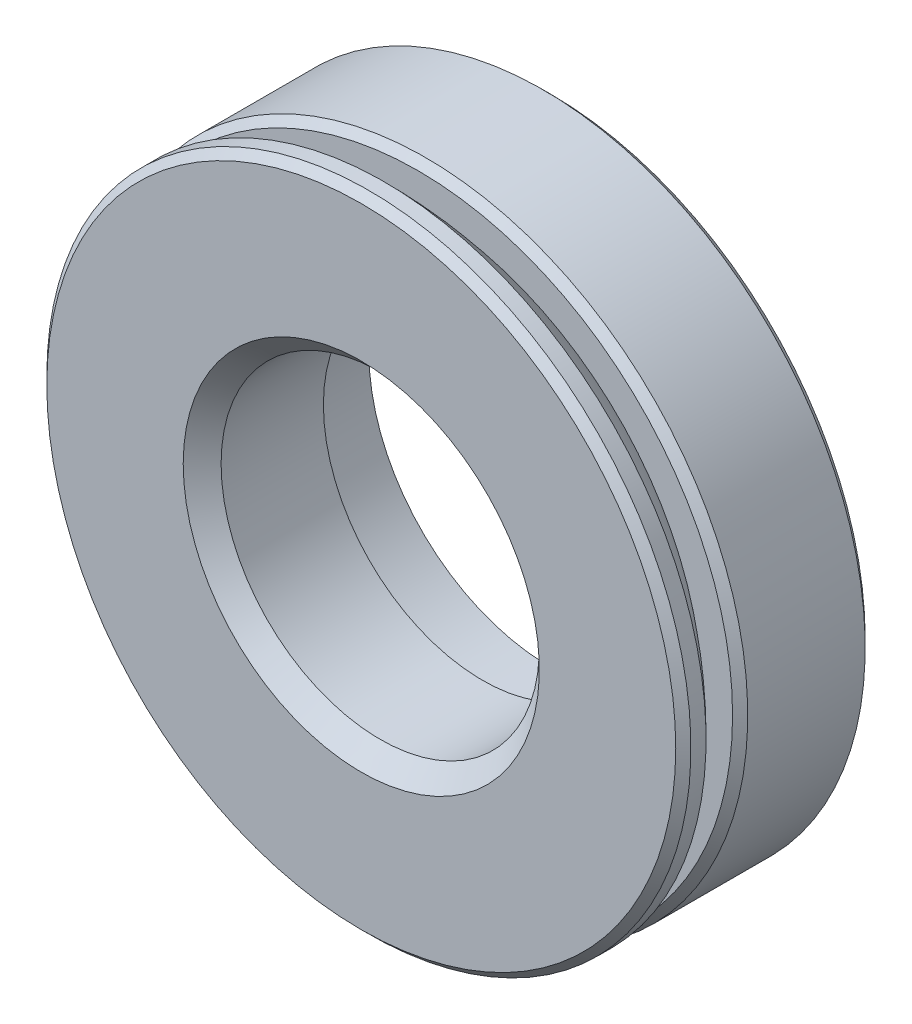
ISO-10303-21;
HEADER;
FILE_DESCRIPTION(('STEP AP214'),'2;1');
FILE_NAME('part.step','',(''),(''),'','','');
FILE_SCHEMA(('AUTOMOTIVE_DESIGN { 1 0 10303 214 1 1 1 1 }'));
ENDSEC;
DATA;
#1=APPLICATION_CONTEXT('core data for automotive mechanical design processes');
#2=APPLICATION_PROTOCOL_DEFINITION('international standard','automotive_design',2000,#1);
#3=PRODUCT_CONTEXT('',#1,'mechanical');
#4=PRODUCT('Part','Part','',(#3));
#5=PRODUCT_RELATED_PRODUCT_CATEGORY('part','',(#4));
#6=PRODUCT_DEFINITION_FORMATION('','',#4);
#7=PRODUCT_DEFINITION_CONTEXT('part definition',#1,'design');
#8=PRODUCT_DEFINITION('design','',#6,#7);
#9=PRODUCT_DEFINITION_SHAPE('','',#8);
#10=(LENGTH_UNIT() NAMED_UNIT(*) SI_UNIT(.MILLI.,.METRE.));
#11=(NAMED_UNIT(*) PLANE_ANGLE_UNIT() SI_UNIT($,.RADIAN.));
#12=(NAMED_UNIT(*) SI_UNIT($,.STERADIAN.) SOLID_ANGLE_UNIT());
#13=UNCERTAINTY_MEASURE_WITH_UNIT(LENGTH_MEASURE(1.E-05),#10,'distance_accuracy_value','');
#14=(GEOMETRIC_REPRESENTATION_CONTEXT(3) GLOBAL_UNCERTAINTY_ASSIGNED_CONTEXT((#13)) GLOBAL_UNIT_ASSIGNED_CONTEXT((#10,
#11,#12)) REPRESENTATION_CONTEXT('',''));
#15=CARTESIAN_POINT('',(0.,0.,0.));
#16=DIRECTION('',(0.,0.,1.));
#17=DIRECTION('',(1.,0.,0.));
#18=AXIS2_PLACEMENT_3D('',#15,#16,#17);
#19=CARTESIAN_POINT('',(0.,0.,7.78549184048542));
#20=DIRECTION('',(0.,0.,1.));
#21=DIRECTION('',(-1.,0.,0.));
#22=AXIS2_PLACEMENT_3D('',#19,#20,#21);
#23=CYLINDRICAL_SURFACE('',#22,4.2);
#24=CARTESIAN_POINT('',(0.,0.,1.79999184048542));
#25=DIRECTION('',(0.,0.,1.));
#26=DIRECTION('',(-1.,0.,0.));
#27=AXIS2_PLACEMENT_3D('',#24,#25,#26);
#28=CIRCLE('',#27,4.2);
#29=CARTESIAN_POINT('',(-4.2,0.,1.79999184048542));
#30=VERTEX_POINT('',#29);
#31=EDGE_CURVE('E8',#30,#30,#28,.T.);
#32=ORIENTED_EDGE('',*,*,#31,.F.);
#33=EDGE_LOOP('',(#32));
#34=FACE_BOUND('',#33,.T.);
#35=CARTESIAN_POINT('',(0.,0.,4.49999184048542));
#36=DIRECTION('',(0.,0.,1.));
#37=DIRECTION('',(-1.,0.,0.));
#38=AXIS2_PLACEMENT_3D('',#35,#36,#37);
#39=CIRCLE('',#38,4.2);
#40=CARTESIAN_POINT('',(-4.2,0.,4.49999184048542));
#41=VERTEX_POINT('',#40);
#42=EDGE_CURVE('E55',#41,#41,#39,.T.);
#43=ORIENTED_EDGE('',*,*,#42,.T.);
#44=EDGE_LOOP('',(#43));
#45=FACE_BOUND('',#44,.T.);
#46=ADVANCED_FACE('F12',(#34,#45),#23,.F.);
#47=CARTESIAN_POINT('',(4.2,0.,1.79999184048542));
#48=DIRECTION('',(0.,0.,1.));
#49=DIRECTION('',(-1.,0.,0.));
#50=AXIS2_PLACEMENT_3D('',#47,#48,#49);
#51=PLANE('',#50);
#52=CARTESIAN_POINT('',(0.,0.,1.79999184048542));
#53=DIRECTION('',(0.,0.,1.));
#54=DIRECTION('',(-1.,0.,0.));
#55=AXIS2_PLACEMENT_3D('',#52,#53,#54);
#56=CIRCLE('',#55,4.8);
#57=CARTESIAN_POINT('',(-4.8,0.,1.79999184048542));
#58=VERTEX_POINT('',#57);
#59=EDGE_CURVE('E18',#58,#58,#56,.T.);
#60=ORIENTED_EDGE('',*,*,#59,.F.);
#61=EDGE_LOOP('',(#60));
#62=FACE_BOUND('',#61,.T.);
#63=ORIENTED_EDGE('',*,*,#31,.T.);
#64=EDGE_LOOP('',(#63));
#65=FACE_BOUND('',#64,.T.);
#66=ADVANCED_FACE('F122',(#62,#65),#51,.F.);
#67=CARTESIAN_POINT('',(0.,0.,7.78549184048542));
#68=DIRECTION('',(0.,0.,1.));
#69=DIRECTION('',(-1.,0.,0.));
#70=AXIS2_PLACEMENT_3D('',#67,#68,#69);
#71=CYLINDRICAL_SURFACE('',#70,4.8);
#72=CARTESIAN_POINT('',(0.,0.,0.));
#73=DIRECTION('',(0.,0.,1.));
#74=DIRECTION('',(-1.,0.,0.));
#75=AXIS2_PLACEMENT_3D('',#72,#73,#74);
#76=CIRCLE('',#75,4.8);
#77=CARTESIAN_POINT('',(-4.8,0.,0.));
#78=VERTEX_POINT('',#77);
#79=EDGE_CURVE('E22',#78,#78,#76,.T.);
#80=ORIENTED_EDGE('',*,*,#79,.F.);
#81=EDGE_LOOP('',(#80));
#82=FACE_BOUND('',#81,.T.);
#83=ORIENTED_EDGE('',*,*,#59,.T.);
#84=EDGE_LOOP('',(#83));
#85=FACE_BOUND('',#84,.T.);
#86=ADVANCED_FACE('F117',(#82,#85),#71,.F.);
#87=CARTESIAN_POINT('',(4.8,0.,0.));
#88=DIRECTION('',(0.,0.,1.));
#89=DIRECTION('',(-1.,0.,0.));
#90=AXIS2_PLACEMENT_3D('',#87,#88,#89);
#91=PLANE('',#90);
#92=CARTESIAN_POINT('',(0.,0.,0.));
#93=DIRECTION('',(0.,0.,1.));
#94=DIRECTION('',(-1.,0.,0.));
#95=AXIS2_PLACEMENT_3D('',#92,#93,#94);
#96=CIRCLE('',#95,8.3);
#97=CARTESIAN_POINT('',(-8.3,0.,0.));
#98=VERTEX_POINT('',#97);
#99=EDGE_CURVE('E26',#98,#98,#96,.T.);
#100=ORIENTED_EDGE('',*,*,#99,.F.);
#101=EDGE_LOOP('',(#100));
#102=FACE_BOUND('',#101,.T.);
#103=ORIENTED_EDGE('',*,*,#79,.T.);
#104=EDGE_LOOP('',(#103));
#105=FACE_BOUND('',#104,.T.);
#106=ADVANCED_FACE('F111',(#102,#105),#91,.F.);
#107=CARTESIAN_POINT('',(0.,0.,0.));
#108=DIRECTION('',(0.,0.,1.));
#109=DIRECTION('',(-1.,0.,0.));
#110=AXIS2_PLACEMENT_3D('',#107,#108,#109);
#111=CONICAL_SURFACE('',#110,8.3,0.785398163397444);
#112=CARTESIAN_POINT('',(0.,0.,0.2));
#113=DIRECTION('',(0.,0.,1.));
#114=DIRECTION('',(-1.,0.,0.));
#115=AXIS2_PLACEMENT_3D('',#112,#113,#114);
#116=CIRCLE('',#115,8.5);
#117=CARTESIAN_POINT('',(-8.5,0.,0.2));
#118=VERTEX_POINT('',#117);
#119=EDGE_CURVE('E31',#118,#118,#116,.T.);
#120=ORIENTED_EDGE('',*,*,#119,.F.);
#121=EDGE_LOOP('',(#120));
#122=FACE_BOUND('',#121,.T.);
#123=ORIENTED_EDGE('',*,*,#99,.T.);
#124=EDGE_LOOP('',(#123));
#125=FACE_BOUND('',#124,.T.);
#126=ADVANCED_FACE('F105',(#122,#125),#111,.T.);
#127=CARTESIAN_POINT('',(0.,0.,7.78549184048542));
#128=DIRECTION('',(0.,0.,1.));
#129=DIRECTION('',(-1.,0.,0.));
#130=AXIS2_PLACEMENT_3D('',#127,#128,#129);
#131=CYLINDRICAL_SURFACE('',#130,8.5);
#132=CARTESIAN_POINT('',(0.,0.,3.3));
#133=DIRECTION('',(0.,0.,1.));
#134=DIRECTION('',(-1.,0.,0.));
#135=AXIS2_PLACEMENT_3D('',#132,#133,#134);
#136=CIRCLE('',#135,8.5);
#137=CARTESIAN_POINT('',(-8.5,0.,3.3));
#138=VERTEX_POINT('',#137);
#139=EDGE_CURVE('E34',#138,#138,#136,.T.);
#140=ORIENTED_EDGE('',*,*,#139,.F.);
#141=EDGE_LOOP('',(#140));
#142=FACE_BOUND('',#141,.T.);
#143=ORIENTED_EDGE('',*,*,#119,.T.);
#144=EDGE_LOOP('',(#143));
#145=FACE_BOUND('',#144,.T.);
#146=ADVANCED_FACE('F99',(#142,#145),#131,.T.);
#147=CARTESIAN_POINT('',(0.,0.,3.3));
#148=DIRECTION('',(0.,0.,-1.));
#149=DIRECTION('',(1.,0.,0.));
#150=AXIS2_PLACEMENT_3D('',#147,#148,#149);
#151=CONICAL_SURFACE('',#150,8.5,0.785398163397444);
#152=CARTESIAN_POINT('',(0.,0.,3.5));
#153=DIRECTION('',(0.,0.,1.));
#154=DIRECTION('',(-1.,0.,0.));
#155=AXIS2_PLACEMENT_3D('',#152,#153,#154);
#156=CIRCLE('',#155,8.3);
#157=CARTESIAN_POINT('',(-8.3,0.,3.5));
#158=VERTEX_POINT('',#157);
#159=EDGE_CURVE('E37',#158,#158,#156,.T.);
#160=ORIENTED_EDGE('',*,*,#159,.F.);
#161=EDGE_LOOP('',(#160));
#162=FACE_BOUND('',#161,.T.);
#163=ORIENTED_EDGE('',*,*,#139,.T.);
#164=EDGE_LOOP('',(#163));
#165=FACE_BOUND('',#164,.T.);
#166=ADVANCED_FACE('F93',(#162,#165),#151,.T.);
#167=CARTESIAN_POINT('',(7.49608762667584,0.,3.5));
#168=DIRECTION('',(0.,0.,-1.));
#169=DIRECTION('',(1.,0.,0.));
#170=AXIS2_PLACEMENT_3D('',#167,#168,#169);
#171=PLANE('',#170);
#172=CARTESIAN_POINT('',(0.,0.,3.5));
#173=DIRECTION('',(0.,0.,1.));
#174=DIRECTION('',(-1.,0.,0.));
#175=AXIS2_PLACEMENT_3D('',#172,#173,#174);
#176=CIRCLE('',#175,7.49608762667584);
#177=CARTESIAN_POINT('',(-7.49608762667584,0.,3.5));
#178=VERTEX_POINT('',#177);
#179=EDGE_CURVE('E40',#178,#178,#176,.T.);
#180=ORIENTED_EDGE('',*,*,#179,.F.);
#181=EDGE_LOOP('',(#180));
#182=FACE_BOUND('',#181,.T.);
#183=ORIENTED_EDGE('',*,*,#159,.T.);
#184=EDGE_LOOP('',(#183));
#185=FACE_BOUND('',#184,.T.);
#186=ADVANCED_FACE('F87',(#182,#185),#171,.F.);
#187=CARTESIAN_POINT('',(0.,0.,12.8710173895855));
#188=DIRECTION('',(0.,0.,1.));
#189=DIRECTION('',(-1.,0.,0.));
#190=AXIS2_PLACEMENT_3D('',#187,#188,#189);
#191=DEGENERATE_TOROIDAL_SURFACE('',#190,0.000486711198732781,12.0000000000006,.T.);
#192=CARTESIAN_POINT('',(0.,0.,4.39999184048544));
#193=DIRECTION('',(0.,0.,1.));
#194=DIRECTION('',(-1.,0.,0.));
#195=AXIS2_PLACEMENT_3D('',#192,#193,#194);
#196=CIRCLE('',#195,8.5);
#197=CARTESIAN_POINT('',(-8.5,0.,4.39999184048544));
#198=VERTEX_POINT('',#197);
#199=EDGE_CURVE('E43',#198,#198,#196,.T.);
#200=ORIENTED_EDGE('',*,*,#199,.F.);
#201=EDGE_LOOP('',(#200));
#202=FACE_BOUND('',#201,.T.);
#203=ORIENTED_EDGE('',*,*,#179,.T.);
#204=EDGE_LOOP('',(#203));
#205=FACE_BOUND('',#204,.T.);
#206=ADVANCED_FACE('F81',(#202,#205),#191,.T.);
#207=CARTESIAN_POINT('',(0.,0.,7.78549184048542));
#208=DIRECTION('',(0.,0.,1.));
#209=DIRECTION('',(-1.,0.,0.));
#210=AXIS2_PLACEMENT_3D('',#207,#208,#209);
#211=CYLINDRICAL_SURFACE('',#210,8.5);
#212=CARTESIAN_POINT('',(0.,0.,4.79999184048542));
#213=DIRECTION('',(0.,0.,1.));
#214=DIRECTION('',(-1.,0.,0.));
#215=AXIS2_PLACEMENT_3D('',#212,#213,#214);
#216=CIRCLE('',#215,8.5);
#217=CARTESIAN_POINT('',(-8.5,0.,4.79999184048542));
#218=VERTEX_POINT('',#217);
#219=EDGE_CURVE('E46',#218,#218,#216,.T.);
#220=ORIENTED_EDGE('',*,*,#219,.F.);
#221=EDGE_LOOP('',(#220));
#222=FACE_BOUND('',#221,.T.);
#223=ORIENTED_EDGE('',*,*,#199,.T.);
#224=EDGE_LOOP('',(#223));
#225=FACE_BOUND('',#224,.T.);
#226=ADVANCED_FACE('F75',(#222,#225),#211,.T.);
#227=CARTESIAN_POINT('',(0.,0.,4.79999184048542));
#228=DIRECTION('',(0.,0.,-1.));
#229=DIRECTION('',(1.,0.,0.));
#230=AXIS2_PLACEMENT_3D('',#227,#228,#229);
#231=CONICAL_SURFACE('',#230,8.5,0.785398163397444);
#232=CARTESIAN_POINT('',(0.,0.,4.99999184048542));
#233=DIRECTION('',(0.,0.,1.));
#234=DIRECTION('',(-1.,0.,0.));
#235=AXIS2_PLACEMENT_3D('',#232,#233,#234);
#236=CIRCLE('',#235,8.3);
#237=CARTESIAN_POINT('',(-8.3,0.,4.99999184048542));
#238=VERTEX_POINT('',#237);
#239=EDGE_CURVE('E49',#238,#238,#236,.T.);
#240=ORIENTED_EDGE('',*,*,#239,.F.);
#241=EDGE_LOOP('',(#240));
#242=FACE_BOUND('',#241,.T.);
#243=ORIENTED_EDGE('',*,*,#219,.T.);
#244=EDGE_LOOP('',(#243));
#245=FACE_BOUND('',#244,.T.);
#246=ADVANCED_FACE('F69',(#242,#245),#231,.T.);
#247=CARTESIAN_POINT('',(8.3,0.,4.99999184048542));
#248=DIRECTION('',(0.,0.,-1.));
#249=DIRECTION('',(1.,0.,0.));
#250=AXIS2_PLACEMENT_3D('',#247,#248,#249);
#251=PLANE('',#250);
#252=CARTESIAN_POINT('',(0.,0.,4.99999184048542));
#253=DIRECTION('',(0.,0.,1.));
#254=DIRECTION('',(-1.,0.,0.));
#255=AXIS2_PLACEMENT_3D('',#252,#253,#254);
#256=CIRCLE('',#255,4.7);
#257=CARTESIAN_POINT('',(-4.7,0.,4.99999184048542));
#258=VERTEX_POINT('',#257);
#259=EDGE_CURVE('E52',#258,#258,#256,.T.);
#260=ORIENTED_EDGE('',*,*,#259,.F.);
#261=EDGE_LOOP('',(#260));
#262=FACE_BOUND('',#261,.T.);
#263=ORIENTED_EDGE('',*,*,#239,.T.);
#264=EDGE_LOOP('',(#263));
#265=FACE_BOUND('',#264,.T.);
#266=ADVANCED_FACE('F63',(#262,#265),#251,.F.);
#267=CARTESIAN_POINT('',(0.,0.,4.99999184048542));
#268=DIRECTION('',(0.,0.,1.));
#269=DIRECTION('',(-1.,0.,0.));
#270=AXIS2_PLACEMENT_3D('',#267,#268,#269);
#271=CONICAL_SURFACE('',#270,4.7,0.78539816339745);
#272=ORIENTED_EDGE('',*,*,#42,.F.);
#273=EDGE_LOOP('',(#272));
#274=FACE_BOUND('',#273,.T.);
#275=ORIENTED_EDGE('',*,*,#259,.T.);
#276=EDGE_LOOP('',(#275));
#277=FACE_BOUND('',#276,.T.);
#278=ADVANCED_FACE('F60',(#274,#277),#271,.F.);
#279=CLOSED_SHELL('',(#46,#66,#86,#106,#126,#146,#166,#186,#206,#226,#246,#266,#278));
#280=MANIFOLD_SOLID_BREP('B1',#279);
#281=ADVANCED_BREP_SHAPE_REPRESENTATION('',(#18,#280),#14);
#282=SHAPE_DEFINITION_REPRESENTATION(#9,#281);
ENDSEC;
END-ISO-10303-21;
